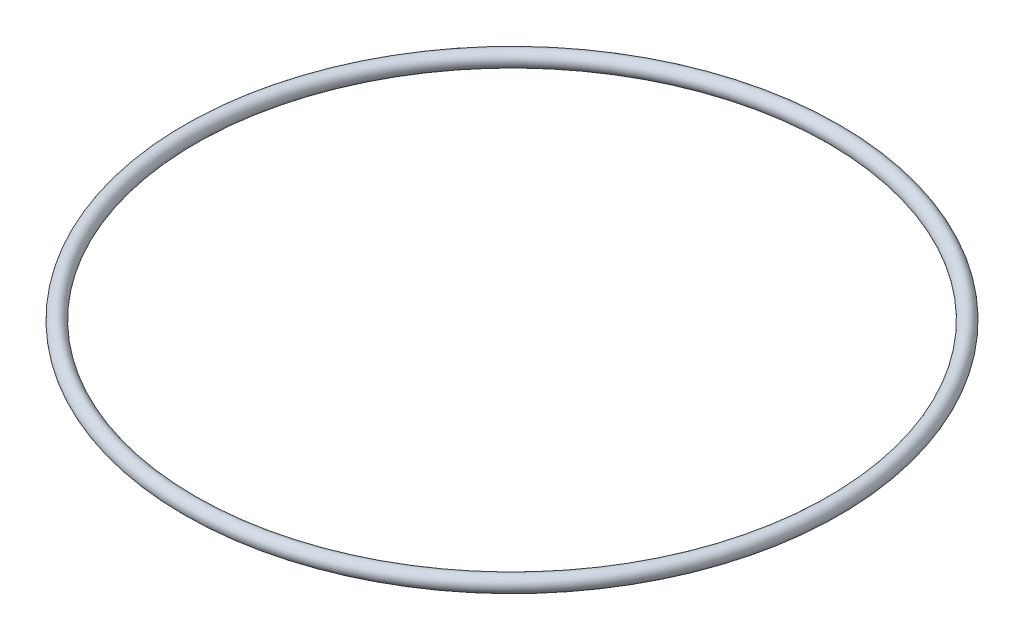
ISO-10303-21;
HEADER;
FILE_DESCRIPTION(('STEP AP214'),'2;1');
FILE_NAME('part.step','',(''),(''),'','','');
FILE_SCHEMA(('AUTOMOTIVE_DESIGN { 1 0 10303 214 1 1 1 1 }'));
ENDSEC;
DATA;
#1=APPLICATION_CONTEXT('core data for automotive mechanical design processes');
#2=APPLICATION_PROTOCOL_DEFINITION('international standard','automotive_design',2000,#1);
#3=PRODUCT_CONTEXT('',#1,'mechanical');
#4=PRODUCT('Part','Part','',(#3));
#5=PRODUCT_RELATED_PRODUCT_CATEGORY('part','',(#4));
#6=PRODUCT_DEFINITION_FORMATION('','',#4);
#7=PRODUCT_DEFINITION_CONTEXT('part definition',#1,'design');
#8=PRODUCT_DEFINITION('design','',#6,#7);
#9=PRODUCT_DEFINITION_SHAPE('','',#8);
#10=(LENGTH_UNIT() NAMED_UNIT(*) SI_UNIT(.MILLI.,.METRE.));
#11=(NAMED_UNIT(*) PLANE_ANGLE_UNIT() SI_UNIT($,.RADIAN.));
#12=(NAMED_UNIT(*) SI_UNIT($,.STERADIAN.) SOLID_ANGLE_UNIT());
#13=UNCERTAINTY_MEASURE_WITH_UNIT(LENGTH_MEASURE(1.E-05),#10,'distance_accuracy_value','');
#14=(GEOMETRIC_REPRESENTATION_CONTEXT(3) GLOBAL_UNCERTAINTY_ASSIGNED_CONTEXT((#13)) GLOBAL_UNIT_ASSIGNED_CONTEXT((#10,
#11,#12)) REPRESENTATION_CONTEXT('',''));
#15=CARTESIAN_POINT('',(0.,0.,0.));
#16=DIRECTION('',(0.,0.,1.));
#17=DIRECTION('',(1.,0.,0.));
#18=AXIS2_PLACEMENT_3D('',#15,#16,#17);
#19=CARTESIAN_POINT('',(0.,0.,0.));
#20=DIRECTION('',(0.,1.,0.));
#21=DIRECTION('',(0.,0.,1.));
#22=AXIS2_PLACEMENT_3D('',#19,#20,#21);
#23=TOROIDAL_SURFACE('',#22,63.,1.5);
#24=CARTESIAN_POINT('',(0.,0.,64.5));
#25=VERTEX_POINT('',#24);
#26=VERTEX_LOOP('',#25);
#27=FACE_BOUND('',#26,.T.);
#28=ADVANCED_FACE('F29',(#27),#23,.T.);
#29=CLOSED_SHELL('',(#28));
#30=MANIFOLD_SOLID_BREP('B2',#29);
#31=ADVANCED_BREP_SHAPE_REPRESENTATION('',(#18,#30),#14);
#32=SHAPE_DEFINITION_REPRESENTATION(#9,#31);
ENDSEC;
END-ISO-10303-21;
